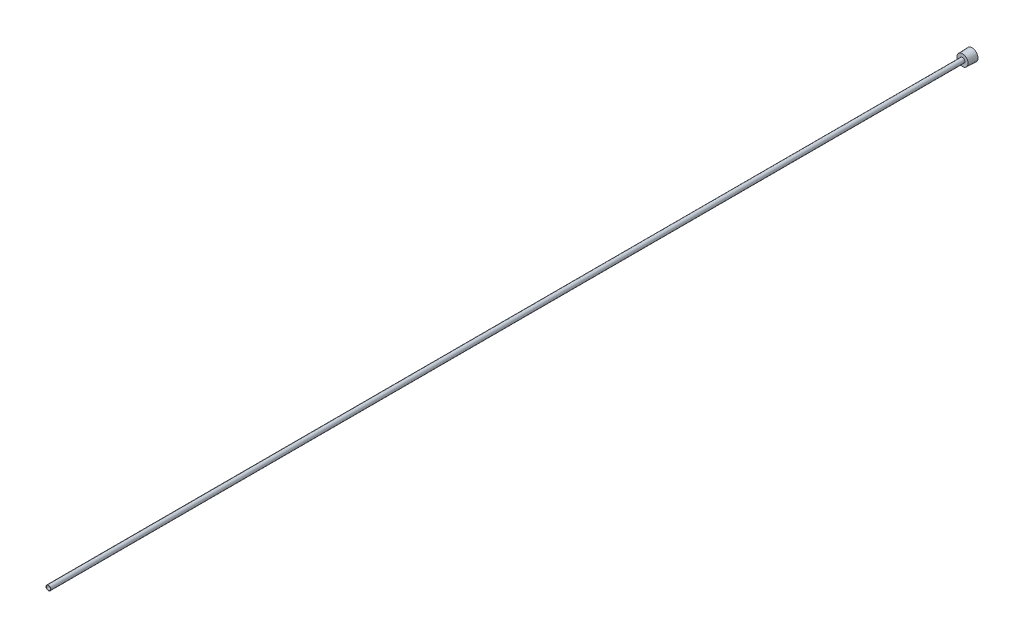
ISO-10303-21;
HEADER;
FILE_DESCRIPTION(('STEP AP214'),'2;1');
FILE_NAME('part.step','',(''),(''),'','','');
FILE_SCHEMA(('AUTOMOTIVE_DESIGN { 1 0 10303 214 1 1 1 1 }'));
ENDSEC;
DATA;
#1=APPLICATION_CONTEXT('core data for automotive mechanical design processes');
#2=APPLICATION_PROTOCOL_DEFINITION('international standard','automotive_design',2000,#1);
#3=PRODUCT_CONTEXT('',#1,'mechanical');
#4=PRODUCT('Part','Part','',(#3));
#5=PRODUCT_RELATED_PRODUCT_CATEGORY('part','',(#4));
#6=PRODUCT_DEFINITION_FORMATION('','',#4);
#7=PRODUCT_DEFINITION_CONTEXT('part definition',#1,'design');
#8=PRODUCT_DEFINITION('design','',#6,#7);
#9=PRODUCT_DEFINITION_SHAPE('','',#8);
#10=(LENGTH_UNIT() NAMED_UNIT(*) SI_UNIT(.MILLI.,.METRE.));
#11=(NAMED_UNIT(*) PLANE_ANGLE_UNIT() SI_UNIT($,.RADIAN.));
#12=(NAMED_UNIT(*) SI_UNIT($,.STERADIAN.) SOLID_ANGLE_UNIT());
#13=UNCERTAINTY_MEASURE_WITH_UNIT(LENGTH_MEASURE(1.E-05),#10,'distance_accuracy_value','');
#14=(GEOMETRIC_REPRESENTATION_CONTEXT(3) GLOBAL_UNCERTAINTY_ASSIGNED_CONTEXT((#13)) GLOBAL_UNIT_ASSIGNED_CONTEXT((#10,
#11,#12)) REPRESENTATION_CONTEXT('',''));
#15=CARTESIAN_POINT('',(0.,0.,0.));
#16=DIRECTION('',(0.,0.,1.));
#17=DIRECTION('',(1.,0.,0.));
#18=AXIS2_PLACEMENT_3D('',#15,#16,#17);
#19=CARTESIAN_POINT('',(0.,0.,0.));
#20=DIRECTION('',(0.,0.,1.));
#21=DIRECTION('',(1.,0.,0.));
#22=AXIS2_PLACEMENT_3D('',#19,#20,#21);
#23=CYLINDRICAL_SURFACE('',#22,1.3843);
#24=CARTESIAN_POINT('',(0.,0.,609.6));
#25=DIRECTION('',(0.,0.,1.));
#26=DIRECTION('',(1.,0.,0.));
#27=AXIS2_PLACEMENT_3D('',#24,#25,#26);
#28=CIRCLE('',#27,1.3843);
#29=CARTESIAN_POINT('',(1.3843,0.,609.6));
#30=VERTEX_POINT('',#29);
#31=EDGE_CURVE('E142',#30,#30,#28,.T.);
#32=CARTESIAN_POINT('',(0.,0.,2.54));
#33=DIRECTION('',(0.,0.,-1.));
#34=DIRECTION('',(-1.,0.,0.));
#35=AXIS2_PLACEMENT_3D('',#32,#33,#34);
#36=CIRCLE('',#35,1.3843);
#37=CARTESIAN_POINT('',(1.3843,0.,2.54));
#38=VERTEX_POINT('',#37);
#39=EDGE_CURVE('E37',#38,#38,#36,.F.);
#40=CARTESIAN_POINT('',(1.3843,0.,609.6));
#41=CARTESIAN_POINT('',(1.3843,0.,603.276458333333));
#42=CARTESIAN_POINT('',(1.3843,0.,596.952916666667));
#43=CARTESIAN_POINT('',(1.3843,0.,584.305833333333));
#44=CARTESIAN_POINT('',(1.3843,0.,577.982291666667));
#45=CARTESIAN_POINT('',(1.3843,0.,565.335208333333));
#46=CARTESIAN_POINT('',(1.3843,0.,559.011666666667));
#47=CARTESIAN_POINT('',(1.3843,0.,546.364583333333));
#48=CARTESIAN_POINT('',(1.3843,0.,540.041041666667));
#49=CARTESIAN_POINT('',(1.3843,0.,527.393958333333));
#50=CARTESIAN_POINT('',(1.3843,0.,521.070416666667));
#51=CARTESIAN_POINT('',(1.3843,0.,508.423333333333));
#52=CARTESIAN_POINT('',(1.3843,0.,502.099791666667));
#53=CARTESIAN_POINT('',(1.3843,0.,489.452708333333));
#54=CARTESIAN_POINT('',(1.3843,0.,483.129166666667));
#55=CARTESIAN_POINT('',(1.3843,0.,470.482083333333));
#56=CARTESIAN_POINT('',(1.3843,0.,464.158541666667));
#57=CARTESIAN_POINT('',(1.3843,0.,451.511458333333));
#58=CARTESIAN_POINT('',(1.3843,0.,445.187916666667));
#59=CARTESIAN_POINT('',(1.3843,0.,432.540833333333));
#60=CARTESIAN_POINT('',(1.3843,0.,426.217291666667));
#61=CARTESIAN_POINT('',(1.3843,0.,413.570208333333));
#62=CARTESIAN_POINT('',(1.3843,0.,407.246666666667));
#63=CARTESIAN_POINT('',(1.3843,0.,394.599583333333));
#64=CARTESIAN_POINT('',(1.3843,0.,388.276041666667));
#65=CARTESIAN_POINT('',(1.3843,0.,375.628958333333));
#66=CARTESIAN_POINT('',(1.3843,0.,369.305416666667));
#67=CARTESIAN_POINT('',(1.3843,0.,356.658333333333));
#68=CARTESIAN_POINT('',(1.3843,0.,350.334791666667));
#69=CARTESIAN_POINT('',(1.3843,0.,337.687708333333));
#70=CARTESIAN_POINT('',(1.3843,0.,331.364166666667));
#71=CARTESIAN_POINT('',(1.3843,0.,318.717083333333));
#72=CARTESIAN_POINT('',(1.3843,0.,312.393541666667));
#73=CARTESIAN_POINT('',(1.3843,0.,299.746458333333));
#74=CARTESIAN_POINT('',(1.3843,0.,293.422916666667));
#75=CARTESIAN_POINT('',(1.3843,0.,280.775833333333));
#76=CARTESIAN_POINT('',(1.3843,0.,274.452291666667));
#77=CARTESIAN_POINT('',(1.3843,0.,261.805208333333));
#78=CARTESIAN_POINT('',(1.3843,0.,255.481666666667));
#79=CARTESIAN_POINT('',(1.3843,0.,242.834583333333));
#80=CARTESIAN_POINT('',(1.3843,0.,236.511041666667));
#81=CARTESIAN_POINT('',(1.3843,0.,223.863958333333));
#82=CARTESIAN_POINT('',(1.3843,0.,217.540416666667));
#83=CARTESIAN_POINT('',(1.3843,0.,204.893333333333));
#84=CARTESIAN_POINT('',(1.3843,0.,198.569791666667));
#85=CARTESIAN_POINT('',(1.3843,0.,185.922708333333));
#86=CARTESIAN_POINT('',(1.3843,0.,179.599166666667));
#87=CARTESIAN_POINT('',(1.3843,0.,166.952083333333));
#88=CARTESIAN_POINT('',(1.3843,0.,160.628541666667));
#89=CARTESIAN_POINT('',(1.3843,0.,147.981458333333));
#90=CARTESIAN_POINT('',(1.3843,0.,141.657916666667));
#91=CARTESIAN_POINT('',(1.3843,0.,129.010833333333));
#92=CARTESIAN_POINT('',(1.3843,0.,122.687291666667));
#93=CARTESIAN_POINT('',(1.3843,0.,110.040208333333));
#94=CARTESIAN_POINT('',(1.3843,0.,103.716666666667));
#95=CARTESIAN_POINT('',(1.3843,0.,91.0695833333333));
#96=CARTESIAN_POINT('',(1.3843,0.,84.7460416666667));
#97=CARTESIAN_POINT('',(1.3843,0.,72.0989583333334));
#98=CARTESIAN_POINT('',(1.3843,0.,65.7754166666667));
#99=CARTESIAN_POINT('',(1.3843,0.,53.1283333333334));
#100=CARTESIAN_POINT('',(1.3843,0.,46.8047916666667));
#101=CARTESIAN_POINT('',(1.3843,0.,34.1577083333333));
#102=CARTESIAN_POINT('',(1.3843,0.,27.8341666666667));
#103=CARTESIAN_POINT('',(1.3843,0.,15.1870833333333));
#104=CARTESIAN_POINT('',(1.3843,0.,8.86354166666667));
#105=CARTESIAN_POINT('',(1.3843,0.,2.53999999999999));
#106=B_SPLINE_CURVE_WITH_KNOTS('',3,(#40,#41,#42,#43,#44,#45,#46,#47,#48,#49,#50,#51,#52,#53,
#54,#55,#56,#57,#58,#59,#60,#61,#62,#63,#64,#65,#66,#67,#68,#69,#70,#71,#72,#73,#74,#75,#76,#77,
#78,#79,#80,#81,#82,#83,#84,#85,#86,#87,#88,#89,#90,#91,#92,#93,#94,#95,#96,#97,#98,#99,#100,
#101,#102,#103,#104,#105),.UNSPECIFIED.,.F.,.F.,(4,2,2,2,2,2,2,2,2,2,2,2,2,2,2,2,2,2,2,2,2,2,2,
2,2,2,2,2,2,2,2,2,4),(0.,18.970625,37.94125,56.9118750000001,75.8825000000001,94.853125,
113.82375,132.794375,151.765,170.735625,189.70625,208.676875,227.6475,246.618125,265.58875,
284.559375,303.53,322.500625,341.47125,360.441875,379.4125,398.383125,417.35375,436.324375,
455.295,474.265625,493.23625,512.206875,531.1775,550.148125,569.11875,588.089375,607.06),.UNSPECIFIED.);
#107=EDGE_CURVE('BSEAM33',#30,#38,#106,.T.);
#108=ORIENTED_EDGE('',*,*,#31,.T.);
#109=ORIENTED_EDGE('',*,*,#39,.F.);
#110=ORIENTED_EDGE('',*,*,#107,.T.);
#111=ORIENTED_EDGE('',*,*,#107,.F.);
#112=EDGE_LOOP('',(#108,#110,#109,#111));
#113=FACE_BOUND('',#112,.T.);
#114=ADVANCED_FACE('F33',(#113),#23,.F.);
#115=CARTESIAN_POINT('',(0.,0.,0.));
#116=DIRECTION('',(0.,0.,1.));
#117=DIRECTION('',(1.,0.,0.));
#118=AXIS2_PLACEMENT_3D('',#115,#116,#117);
#119=PLANE('',#118);
#120=DIRECTION('',(1.,0.,0.));
#121=VECTOR('',#120,1.);
#122=CARTESIAN_POINT('',(-1.3748153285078,2.38125,0.));
#123=LINE('',#122,#121);
#124=CARTESIAN_POINT('',(-1.3748153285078,2.38125,0.));
#125=VERTEX_POINT('',#124);
#126=CARTESIAN_POINT('',(1.3748153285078,2.38125,0.));
#127=VERTEX_POINT('',#126);
#128=EDGE_CURVE('E124',#125,#127,#123,.T.);
#129=ORIENTED_EDGE('',*,*,#128,.F.);
#130=DIRECTION('',(0.5,0.866025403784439,0.));
#131=VECTOR('',#130,1.);
#132=CARTESIAN_POINT('',(-2.74963065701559,0.,0.));
#133=LINE('',#132,#131);
#134=CARTESIAN_POINT('',(-2.74963065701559,0.,0.));
#135=VERTEX_POINT('',#134);
#136=EDGE_CURVE('E49',#135,#125,#133,.T.);
#137=ORIENTED_EDGE('',*,*,#136,.F.);
#138=DIRECTION('',(-0.5,0.866025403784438,0.));
#139=VECTOR('',#138,1.);
#140=CARTESIAN_POINT('',(-1.3748153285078,-2.38125,0.));
#141=LINE('',#140,#139);
#142=CARTESIAN_POINT('',(-1.3748153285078,-2.38125,0.));
#143=VERTEX_POINT('',#142);
#144=EDGE_CURVE('E133',#143,#135,#141,.T.);
#145=ORIENTED_EDGE('',*,*,#144,.F.);
#146=DIRECTION('',(-1.,0.,0.));
#147=VECTOR('',#146,1.);
#148=CARTESIAN_POINT('',(1.3748153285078,-2.38125,0.));
#149=LINE('',#148,#147);
#150=CARTESIAN_POINT('',(1.3748153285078,-2.38125,0.));
#151=VERTEX_POINT('',#150);
#152=EDGE_CURVE('E131',#151,#143,#149,.T.);
#153=ORIENTED_EDGE('',*,*,#152,.F.);
#154=DIRECTION('',(-0.5,-0.866025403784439,0.));
#155=VECTOR('',#154,1.);
#156=CARTESIAN_POINT('',(2.74963065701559,0.,0.));
#157=LINE('',#156,#155);
#158=CARTESIAN_POINT('',(2.74963065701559,0.,0.));
#159=VERTEX_POINT('',#158);
#160=EDGE_CURVE('E97',#159,#151,#157,.T.);
#161=ORIENTED_EDGE('',*,*,#160,.F.);
#162=DIRECTION('',(0.5,-0.866025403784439,0.));
#163=VECTOR('',#162,1.);
#164=CARTESIAN_POINT('',(1.3748153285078,2.38125,0.));
#165=LINE('',#164,#163);
#166=EDGE_CURVE('E127',#127,#159,#165,.T.);
#167=ORIENTED_EDGE('',*,*,#166,.F.);
#168=EDGE_LOOP('',(#129,#137,#145,#153,#161,#167));
#169=FACE_BOUND('',#168,.T.);
#170=CARTESIAN_POINT('',(0.,0.,0.));
#171=DIRECTION('',(0.,0.,1.));
#172=DIRECTION('',(1.,0.,0.));
#173=AXIS2_PLACEMENT_3D('',#170,#171,#172);
#174=CIRCLE('',#173,3.8989);
#175=CARTESIAN_POINT('',(3.8989,0.,0.));
#176=VERTEX_POINT('',#175);
#177=EDGE_CURVE('E11',#176,#176,#174,.T.);
#178=ORIENTED_EDGE('',*,*,#177,.F.);
#179=EDGE_LOOP('',(#178));
#180=FACE_BOUND('',#179,.T.);
#181=ADVANCED_FACE('F35',(#169,#180),#119,.F.);
#182=CARTESIAN_POINT('',(0.,0.,0.));
#183=DIRECTION('',(0.,0.,-1.));
#184=DIRECTION('',(-1.,0.,0.));
#185=AXIS2_PLACEMENT_3D('',#182,#183,#184);
#186=CONICAL_SURFACE('',#185,3.8989,0.0364424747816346);
#187=CARTESIAN_POINT('',(0.,0.,6.35));
#188=DIRECTION('',(0.,0.,1.));
#189=DIRECTION('',(1.,0.,0.));
#190=AXIS2_PLACEMENT_3D('',#187,#188,#189);
#191=CIRCLE('',#190,3.66738778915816);
#192=CARTESIAN_POINT('',(3.66738778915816,0.,6.35));
#193=VERTEX_POINT('',#192);
#194=EDGE_CURVE('E42',#193,#193,#191,.T.);
#195=ORIENTED_EDGE('',*,*,#194,.F.);
#196=EDGE_LOOP('',(#195));
#197=FACE_BOUND('',#196,.T.);
#198=ORIENTED_EDGE('',*,*,#177,.T.);
#199=EDGE_LOOP('',(#198));
#200=FACE_BOUND('',#199,.T.);
#201=ADVANCED_FACE('F156',(#197,#200),#186,.T.);
#202=CARTESIAN_POINT('',(0.,3.66738778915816,6.35));
#203=DIRECTION('',(0.,0.,-1.));
#204=DIRECTION('',(-1.,0.,0.));
#205=AXIS2_PLACEMENT_3D('',#202,#203,#204);
#206=PLANE('',#205);
#207=CARTESIAN_POINT('',(0.,0.,6.35));
#208=DIRECTION('',(0.,0.,1.));
#209=DIRECTION('',(1.,0.,0.));
#210=AXIS2_PLACEMENT_3D('',#207,#208,#209);
#211=CIRCLE('',#210,1.5875);
#212=CARTESIAN_POINT('',(1.5875,0.,6.35));
#213=VERTEX_POINT('',#212);
#214=EDGE_CURVE('E148',#213,#213,#211,.T.);
#215=ORIENTED_EDGE('',*,*,#214,.F.);
#216=EDGE_LOOP('',(#215));
#217=FACE_BOUND('',#216,.T.);
#218=ORIENTED_EDGE('',*,*,#194,.T.);
#219=EDGE_LOOP('',(#218));
#220=FACE_BOUND('',#219,.T.);
#221=ADVANCED_FACE('F154',(#217,#220),#206,.F.);
#222=CARTESIAN_POINT('',(0.,0.,0.));
#223=DIRECTION('',(0.,0.,1.));
#224=DIRECTION('',(1.,0.,0.));
#225=AXIS2_PLACEMENT_3D('',#222,#223,#224);
#226=CYLINDRICAL_SURFACE('',#225,1.58749999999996);
#227=CARTESIAN_POINT('',(0.,0.,609.6));
#228=DIRECTION('',(0.,0.,1.));
#229=DIRECTION('',(1.,0.,0.));
#230=AXIS2_PLACEMENT_3D('',#227,#228,#229);
#231=CIRCLE('',#230,1.58749999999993);
#232=CARTESIAN_POINT('',(1.58749999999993,0.,609.6));
#233=VERTEX_POINT('',#232);
#234=EDGE_CURVE('E145',#233,#233,#231,.T.);
#235=ORIENTED_EDGE('',*,*,#234,.F.);
#236=EDGE_LOOP('',(#235));
#237=FACE_BOUND('',#236,.T.);
#238=ORIENTED_EDGE('',*,*,#214,.T.);
#239=EDGE_LOOP('',(#238));
#240=FACE_BOUND('',#239,.T.);
#241=ADVANCED_FACE('F190',(#237,#240),#226,.T.);
#242=CARTESIAN_POINT('',(0.,1.58749999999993,609.6));
#243=DIRECTION('',(0.,0.,-1.));
#244=DIRECTION('',(-1.,0.,0.));
#245=AXIS2_PLACEMENT_3D('',#242,#243,#244);
#246=PLANE('',#245);
#247=ORIENTED_EDGE('',*,*,#31,.F.);
#248=EDGE_LOOP('',(#247));
#249=FACE_BOUND('',#248,.T.);
#250=ORIENTED_EDGE('',*,*,#234,.T.);
#251=EDGE_LOOP('',(#250));
#252=FACE_BOUND('',#251,.T.);
#253=ADVANCED_FACE('F183',(#249,#252),#246,.F.);
#254=CARTESIAN_POINT('',(-1.3748153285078,2.38125,2.54));
#255=DIRECTION('',(0.,0.,-1.));
#256=DIRECTION('',(-1.,0.,0.));
#257=AXIS2_PLACEMENT_3D('',#254,#255,#256);
#258=PLANE('',#257);
#259=DIRECTION('',(0.5,0.866025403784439,0.));
#260=VECTOR('',#259,1.);
#261=CARTESIAN_POINT('',(-2.74963065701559,0.,2.54));
#262=LINE('',#261,#260);
#263=CARTESIAN_POINT('',(-2.74963065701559,0.,2.54));
#264=VERTEX_POINT('',#263);
#265=CARTESIAN_POINT('',(-1.3748153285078,2.38125,2.54));
#266=VERTEX_POINT('',#265);
#267=EDGE_CURVE('E135',#264,#266,#262,.T.);
#268=ORIENTED_EDGE('',*,*,#267,.T.);
#269=DIRECTION('',(1.,0.,0.));
#270=VECTOR('',#269,1.);
#271=CARTESIAN_POINT('',(-1.3748153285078,2.38125,2.54));
#272=LINE('',#271,#270);
#273=CARTESIAN_POINT('',(1.3748153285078,2.38125,2.54));
#274=VERTEX_POINT('',#273);
#275=EDGE_CURVE('E118',#266,#274,#272,.T.);
#276=ORIENTED_EDGE('',*,*,#275,.T.);
#277=DIRECTION('',(0.5,-0.866025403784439,0.));
#278=VECTOR('',#277,1.);
#279=CARTESIAN_POINT('',(1.3748153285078,2.38125,2.54));
#280=LINE('',#279,#278);
#281=CARTESIAN_POINT('',(2.74963065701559,0.,2.54));
#282=VERTEX_POINT('',#281);
#283=EDGE_CURVE('E116',#274,#282,#280,.T.);
#284=ORIENTED_EDGE('',*,*,#283,.T.);
#285=DIRECTION('',(-0.5,-0.866025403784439,0.));
#286=VECTOR('',#285,1.);
#287=CARTESIAN_POINT('',(2.74963065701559,0.,2.54));
#288=LINE('',#287,#286);
#289=CARTESIAN_POINT('',(1.3748153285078,-2.38125,2.54));
#290=VERTEX_POINT('',#289);
#291=EDGE_CURVE('E94',#282,#290,#288,.T.);
#292=ORIENTED_EDGE('',*,*,#291,.T.);
#293=DIRECTION('',(-1.,0.,0.));
#294=VECTOR('',#293,1.);
#295=CARTESIAN_POINT('',(1.3748153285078,-2.38125,2.54));
#296=LINE('',#295,#294);
#297=CARTESIAN_POINT('',(-1.3748153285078,-2.38125,2.54));
#298=VERTEX_POINT('',#297);
#299=EDGE_CURVE('E105',#290,#298,#296,.T.);
#300=ORIENTED_EDGE('',*,*,#299,.T.);
#301=DIRECTION('',(-0.5,0.866025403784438,0.));
#302=VECTOR('',#301,1.);
#303=CARTESIAN_POINT('',(-1.3748153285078,-2.38125,2.54));
#304=LINE('',#303,#302);
#305=EDGE_CURVE('E109',#298,#264,#304,.T.);
#306=ORIENTED_EDGE('',*,*,#305,.T.);
#307=EDGE_LOOP('',(#268,#276,#284,#292,#300,#306));
#308=FACE_BOUND('',#307,.T.);
#309=ORIENTED_EDGE('',*,*,#39,.T.);
#310=EDGE_LOOP('',(#309));
#311=FACE_BOUND('',#310,.T.);
#312=ADVANCED_FACE('F112',(#308,#311),#258,.T.);
#313=CARTESIAN_POINT('',(-2.74963065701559,0.,2.54));
#314=DIRECTION('',(-0.866025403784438,0.5,0.));
#315=DIRECTION('',(-0.5,-0.866025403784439,0.));
#316=AXIS2_PLACEMENT_3D('',#313,#314,#315);
#317=PLANE('',#316);
#318=ORIENTED_EDGE('',*,*,#136,.T.);
#319=DIRECTION('',(0.,0.,-1.));
#320=VECTOR('',#319,1.);
#321=CARTESIAN_POINT('',(-1.3748153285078,2.38125,2.54));
#322=LINE('',#321,#320);
#323=EDGE_CURVE('E79',#266,#125,#322,.T.);
#324=ORIENTED_EDGE('',*,*,#323,.F.);
#325=ORIENTED_EDGE('',*,*,#267,.F.);
#326=DIRECTION('',(0.,0.,-1.));
#327=VECTOR('',#326,1.);
#328=CARTESIAN_POINT('',(-2.74963065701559,0.,2.54));
#329=LINE('',#328,#327);
#330=EDGE_CURVE('E57',#264,#135,#329,.T.);
#331=ORIENTED_EDGE('',*,*,#330,.T.);
#332=EDGE_LOOP('',(#318,#324,#325,#331));
#333=FACE_BOUND('',#332,.T.);
#334=ADVANCED_FACE('F174',(#333),#317,.F.);
#335=CARTESIAN_POINT('',(-1.3748153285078,-2.38125,2.54));
#336=DIRECTION('',(-0.866025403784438,-0.5,0.));
#337=DIRECTION('',(0.5,-0.866025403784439,0.));
#338=AXIS2_PLACEMENT_3D('',#335,#336,#337);
#339=PLANE('',#338);
#340=ORIENTED_EDGE('',*,*,#144,.T.);
#341=ORIENTED_EDGE('',*,*,#330,.F.);
#342=ORIENTED_EDGE('',*,*,#305,.F.);
#343=DIRECTION('',(0.,0.,-1.));
#344=VECTOR('',#343,1.);
#345=CARTESIAN_POINT('',(-1.3748153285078,-2.38125,2.54));
#346=LINE('',#345,#344);
#347=EDGE_CURVE('E101',#298,#143,#346,.T.);
#348=ORIENTED_EDGE('',*,*,#347,.T.);
#349=EDGE_LOOP('',(#340,#341,#342,#348));
#350=FACE_BOUND('',#349,.T.);
#351=ADVANCED_FACE('F176',(#350),#339,.F.);
#352=CARTESIAN_POINT('',(1.3748153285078,-2.38125,2.54));
#353=DIRECTION('',(0.,-1.,0.));
#354=DIRECTION('',(0.,0.,-1.));
#355=AXIS2_PLACEMENT_3D('',#352,#353,#354);
#356=PLANE('',#355);
#357=ORIENTED_EDGE('',*,*,#152,.T.);
#358=ORIENTED_EDGE('',*,*,#347,.F.);
#359=ORIENTED_EDGE('',*,*,#299,.F.);
#360=DIRECTION('',(0.,0.,-1.));
#361=VECTOR('',#360,1.);
#362=CARTESIAN_POINT('',(1.3748153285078,-2.38125,2.54));
#363=LINE('',#362,#361);
#364=EDGE_CURVE('E90',#290,#151,#363,.T.);
#365=ORIENTED_EDGE('',*,*,#364,.T.);
#366=EDGE_LOOP('',(#357,#358,#359,#365));
#367=FACE_BOUND('',#366,.T.);
#368=ADVANCED_FACE('F106',(#367),#356,.F.);
#369=CARTESIAN_POINT('',(2.74963065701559,0.,2.54));
#370=DIRECTION('',(0.866025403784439,-0.5,0.));
#371=DIRECTION('',(0.5,0.866025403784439,0.));
#372=AXIS2_PLACEMENT_3D('',#369,#370,#371);
#373=PLANE('',#372);
#374=ORIENTED_EDGE('',*,*,#160,.T.);
#375=ORIENTED_EDGE('',*,*,#364,.F.);
#376=ORIENTED_EDGE('',*,*,#291,.F.);
#377=DIRECTION('',(0.,0.,-1.));
#378=VECTOR('',#377,1.);
#379=CARTESIAN_POINT('',(2.74963065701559,0.,2.54));
#380=LINE('',#379,#378);
#381=EDGE_CURVE('E102',#282,#159,#380,.T.);
#382=ORIENTED_EDGE('',*,*,#381,.T.);
#383=EDGE_LOOP('',(#374,#375,#376,#382));
#384=FACE_BOUND('',#383,.T.);
#385=ADVANCED_FACE('F92',(#384),#373,.F.);
#386=CARTESIAN_POINT('',(1.3748153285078,2.38125,2.54));
#387=DIRECTION('',(0.866025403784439,0.5,0.));
#388=DIRECTION('',(-0.5,0.866025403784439,0.));
#389=AXIS2_PLACEMENT_3D('',#386,#387,#388);
#390=PLANE('',#389);
#391=ORIENTED_EDGE('',*,*,#166,.T.);
#392=ORIENTED_EDGE('',*,*,#381,.F.);
#393=ORIENTED_EDGE('',*,*,#283,.F.);
#394=DIRECTION('',(0.,0.,-1.));
#395=VECTOR('',#394,1.);
#396=CARTESIAN_POINT('',(1.3748153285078,2.38125,2.54));
#397=LINE('',#396,#395);
#398=EDGE_CURVE('E139',#274,#127,#397,.T.);
#399=ORIENTED_EDGE('',*,*,#398,.T.);
#400=EDGE_LOOP('',(#391,#392,#393,#399));
#401=FACE_BOUND('',#400,.T.);
#402=ADVANCED_FACE('F246',(#401),#390,.F.);
#403=CARTESIAN_POINT('',(-1.3748153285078,2.38125,2.54));
#404=DIRECTION('',(0.,1.,0.));
#405=DIRECTION('',(-1.,0.,0.));
#406=AXIS2_PLACEMENT_3D('',#403,#404,#405);
#407=PLANE('',#406);
#408=ORIENTED_EDGE('',*,*,#128,.T.);
#409=ORIENTED_EDGE('',*,*,#398,.F.);
#410=ORIENTED_EDGE('',*,*,#275,.F.);
#411=ORIENTED_EDGE('',*,*,#323,.T.);
#412=EDGE_LOOP('',(#408,#409,#410,#411));
#413=FACE_BOUND('',#412,.T.);
#414=ADVANCED_FACE('F172',(#413),#407,.F.);
#415=CLOSED_SHELL('',(#114,#181,#201,#221,#241,#253,#312,#334,#351,#368,#385,#402,#414));
#416=MANIFOLD_SOLID_BREP('B2',#415);
#417=ADVANCED_BREP_SHAPE_REPRESENTATION('',(#18,#416),#14);
#418=SHAPE_DEFINITION_REPRESENTATION(#9,#417);
ENDSEC;
END-ISO-10303-21;
